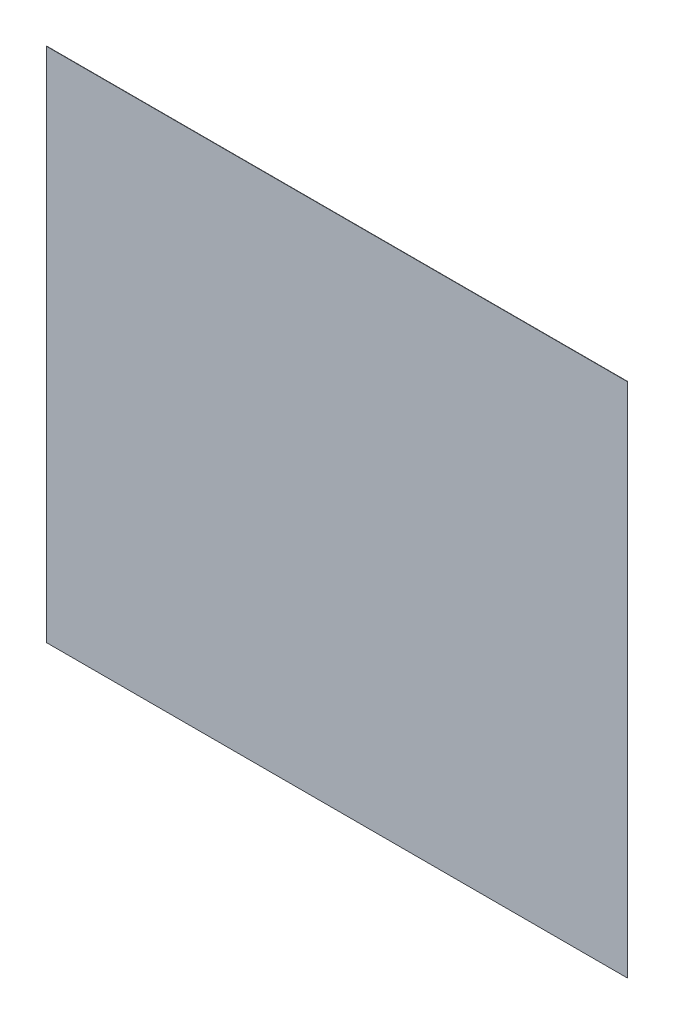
ISO-10303-21;
HEADER;
FILE_DESCRIPTION(('STEP AP214'),'2;1');
FILE_NAME('part.step','',(''),(''),'','','');
FILE_SCHEMA(('AUTOMOTIVE_DESIGN { 1 0 10303 214 1 1 1 1 }'));
ENDSEC;
DATA;
#1=APPLICATION_CONTEXT('core data for automotive mechanical design processes');
#2=APPLICATION_PROTOCOL_DEFINITION('international standard','automotive_design',2000,#1);
#3=PRODUCT_CONTEXT('',#1,'mechanical');
#4=PRODUCT('Part','Part','',(#3));
#5=PRODUCT_RELATED_PRODUCT_CATEGORY('part','',(#4));
#6=PRODUCT_DEFINITION_FORMATION('','',#4);
#7=PRODUCT_DEFINITION_CONTEXT('part definition',#1,'design');
#8=PRODUCT_DEFINITION('design','',#6,#7);
#9=PRODUCT_DEFINITION_SHAPE('','',#8);
#10=(LENGTH_UNIT() NAMED_UNIT(*) SI_UNIT(.MILLI.,.METRE.));
#11=(NAMED_UNIT(*) PLANE_ANGLE_UNIT() SI_UNIT($,.RADIAN.));
#12=(NAMED_UNIT(*) SI_UNIT($,.STERADIAN.) SOLID_ANGLE_UNIT());
#13=UNCERTAINTY_MEASURE_WITH_UNIT(LENGTH_MEASURE(1.E-05),#10,'distance_accuracy_value','');
#14=(GEOMETRIC_REPRESENTATION_CONTEXT(3) GLOBAL_UNCERTAINTY_ASSIGNED_CONTEXT((#13)) GLOBAL_UNIT_ASSIGNED_CONTEXT((#10,
#11,#12)) REPRESENTATION_CONTEXT('',''));
#15=CARTESIAN_POINT('',(0.,0.,0.));
#16=DIRECTION('',(0.,0.,1.));
#17=DIRECTION('',(1.,0.,0.));
#18=AXIS2_PLACEMENT_3D('',#15,#16,#17);
#19=CARTESIAN_POINT('',(90.,-80.,0.1));
#20=DIRECTION('',(-1.,0.,0.));
#21=DIRECTION('',(0.,0.,1.));
#22=AXIS2_PLACEMENT_3D('',#19,#20,#21);
#23=PLANE('',#22);
#24=DIRECTION('',(0.,1.,0.));
#25=VECTOR('',#24,1.);
#26=CARTESIAN_POINT('',(90.,-80.,0.));
#27=LINE('',#26,#25);
#28=CARTESIAN_POINT('',(90.,-80.,0.));
#29=VERTEX_POINT('',#28);
#30=CARTESIAN_POINT('',(90.,80.,0.));
#31=VERTEX_POINT('',#30);
#32=EDGE_CURVE('E109',#29,#31,#27,.T.);
#33=ORIENTED_EDGE('',*,*,#32,.T.);
#34=DIRECTION('',(0.,0.,-1.));
#35=VECTOR('',#34,1.);
#36=CARTESIAN_POINT('',(90.,80.,0.1));
#37=LINE('',#36,#35);
#38=CARTESIAN_POINT('',(90.,80.,0.1));
#39=VERTEX_POINT('',#38);
#40=EDGE_CURVE('E11',#39,#31,#37,.T.);
#41=ORIENTED_EDGE('',*,*,#40,.F.);
#42=DIRECTION('',(0.,1.,0.));
#43=VECTOR('',#42,1.);
#44=CARTESIAN_POINT('',(90.,-80.,0.1));
#45=LINE('',#44,#43);
#46=CARTESIAN_POINT('',(90.,-80.,0.1));
#47=VERTEX_POINT('',#46);
#48=EDGE_CURVE('E93',#47,#39,#45,.T.);
#49=ORIENTED_EDGE('',*,*,#48,.F.);
#50=DIRECTION('',(0.,0.,-1.));
#51=VECTOR('',#50,1.);
#52=CARTESIAN_POINT('',(90.,-80.,0.1));
#53=LINE('',#52,#51);
#54=EDGE_CURVE('E105',#47,#29,#53,.T.);
#55=ORIENTED_EDGE('',*,*,#54,.T.);
#56=EDGE_LOOP('',(#33,#41,#49,#55));
#57=FACE_BOUND('',#56,.T.);
#58=ADVANCED_FACE('F41',(#57),#23,.F.);
#59=CARTESIAN_POINT('',(-90.,80.,0.1));
#60=DIRECTION('',(0.,-1.,0.));
#61=DIRECTION('',(0.,0.,-1.));
#62=AXIS2_PLACEMENT_3D('',#59,#60,#61);
#63=PLANE('',#62);
#64=DIRECTION('',(-1.,0.,0.));
#65=VECTOR('',#64,1.);
#66=CARTESIAN_POINT('',(-90.,80.,0.));
#67=LINE('',#66,#65);
#68=CARTESIAN_POINT('',(-90.,80.,0.));
#69=VERTEX_POINT('',#68);
#70=EDGE_CURVE('E98',#31,#69,#67,.T.);
#71=ORIENTED_EDGE('',*,*,#70,.T.);
#72=DIRECTION('',(0.,0.,-1.));
#73=VECTOR('',#72,1.);
#74=CARTESIAN_POINT('',(-90.,80.,0.1));
#75=LINE('',#74,#73);
#76=CARTESIAN_POINT('',(-90.,80.,0.1));
#77=VERTEX_POINT('',#76);
#78=EDGE_CURVE('E50',#77,#69,#75,.T.);
#79=ORIENTED_EDGE('',*,*,#78,.F.);
#80=DIRECTION('',(-1.,0.,0.));
#81=VECTOR('',#80,1.);
#82=CARTESIAN_POINT('',(-90.,80.,0.1));
#83=LINE('',#82,#81);
#84=EDGE_CURVE('E88',#39,#77,#83,.T.);
#85=ORIENTED_EDGE('',*,*,#84,.F.);
#86=ORIENTED_EDGE('',*,*,#40,.T.);
#87=EDGE_LOOP('',(#71,#79,#85,#86));
#88=FACE_BOUND('',#87,.T.);
#89=ADVANCED_FACE('F97',(#88),#63,.F.);
#90=CARTESIAN_POINT('',(-90.,-80.,0.1));
#91=DIRECTION('',(1.,0.,0.));
#92=DIRECTION('',(0.,0.,-1.));
#93=AXIS2_PLACEMENT_3D('',#90,#91,#92);
#94=PLANE('',#93);
#95=DIRECTION('',(0.,-1.,0.));
#96=VECTOR('',#95,1.);
#97=CARTESIAN_POINT('',(-90.,-80.,0.));
#98=LINE('',#97,#96);
#99=CARTESIAN_POINT('',(-90.,-80.,0.));
#100=VERTEX_POINT('',#99);
#101=EDGE_CURVE('E75',#69,#100,#98,.T.);
#102=ORIENTED_EDGE('',*,*,#101,.T.);
#103=DIRECTION('',(0.,0.,-1.));
#104=VECTOR('',#103,1.);
#105=CARTESIAN_POINT('',(-90.,-80.,0.1));
#106=LINE('',#105,#104);
#107=CARTESIAN_POINT('',(-90.,-80.,0.1));
#108=VERTEX_POINT('',#107);
#109=EDGE_CURVE('E100',#108,#100,#106,.T.);
#110=ORIENTED_EDGE('',*,*,#109,.F.);
#111=DIRECTION('',(0.,-1.,0.));
#112=VECTOR('',#111,1.);
#113=CARTESIAN_POINT('',(-90.,-80.,0.1));
#114=LINE('',#113,#112);
#115=EDGE_CURVE('E91',#77,#108,#114,.T.);
#116=ORIENTED_EDGE('',*,*,#115,.F.);
#117=ORIENTED_EDGE('',*,*,#78,.T.);
#118=EDGE_LOOP('',(#102,#110,#116,#117));
#119=FACE_BOUND('',#118,.T.);
#120=ADVANCED_FACE('F101',(#119),#94,.F.);
#121=CARTESIAN_POINT('',(-90.,-80.,0.1));
#122=DIRECTION('',(0.,1.,0.));
#123=DIRECTION('',(0.,0.,1.));
#124=AXIS2_PLACEMENT_3D('',#121,#122,#123);
#125=PLANE('',#124);
#126=DIRECTION('',(1.,0.,0.));
#127=VECTOR('',#126,1.);
#128=CARTESIAN_POINT('',(-90.,-80.,0.));
#129=LINE('',#128,#127);
#130=EDGE_CURVE('E81',#100,#29,#129,.T.);
#131=ORIENTED_EDGE('',*,*,#130,.T.);
#132=ORIENTED_EDGE('',*,*,#54,.F.);
#133=DIRECTION('',(1.,0.,0.));
#134=VECTOR('',#133,1.);
#135=CARTESIAN_POINT('',(-90.,-80.,0.1));
#136=LINE('',#135,#134);
#137=EDGE_CURVE('E58',#108,#47,#136,.T.);
#138=ORIENTED_EDGE('',*,*,#137,.F.);
#139=ORIENTED_EDGE('',*,*,#109,.T.);
#140=EDGE_LOOP('',(#131,#132,#138,#139));
#141=FACE_BOUND('',#140,.T.);
#142=ADVANCED_FACE('F122',(#141),#125,.F.);
#143=CARTESIAN_POINT('',(0.,0.,0.1));
#144=DIRECTION('',(0.,0.,-1.));
#145=DIRECTION('',(-1.,0.,0.));
#146=AXIS2_PLACEMENT_3D('',#143,#144,#145);
#147=PLANE('',#146);
#148=ORIENTED_EDGE('',*,*,#48,.T.);
#149=ORIENTED_EDGE('',*,*,#84,.T.);
#150=ORIENTED_EDGE('',*,*,#115,.T.);
#151=ORIENTED_EDGE('',*,*,#137,.T.);
#152=EDGE_LOOP('',(#148,#149,#150,#151));
#153=FACE_BOUND('',#152,.T.);
#154=ADVANCED_FACE('F89',(#153),#147,.F.);
#155=CARTESIAN_POINT('',(0.,0.,0.));
#156=DIRECTION('',(0.,0.,-1.));
#157=DIRECTION('',(-1.,0.,0.));
#158=AXIS2_PLACEMENT_3D('',#155,#156,#157);
#159=PLANE('',#158);
#160=ORIENTED_EDGE('',*,*,#32,.F.);
#161=ORIENTED_EDGE('',*,*,#130,.F.);
#162=ORIENTED_EDGE('',*,*,#101,.F.);
#163=ORIENTED_EDGE('',*,*,#70,.F.);
#164=EDGE_LOOP('',(#160,#161,#162,#163));
#165=FACE_BOUND('',#164,.T.);
#166=ADVANCED_FACE('F125',(#165),#159,.T.);
#167=CLOSED_SHELL('',(#58,#89,#120,#142,#154,#166));
#168=MANIFOLD_SOLID_BREP('B2',#167);
#169=ADVANCED_BREP_SHAPE_REPRESENTATION('',(#18,#168),#14);
#170=SHAPE_DEFINITION_REPRESENTATION(#9,#169);
ENDSEC;
END-ISO-10303-21;
